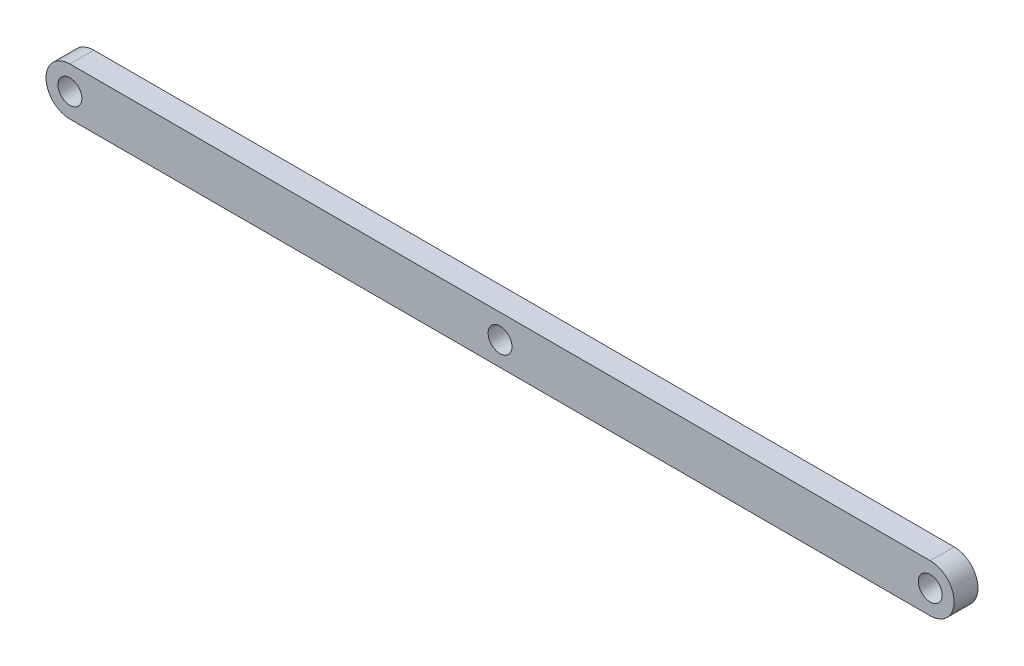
from build123d import *

# Parameters (mm, degrees)
SKETCH1_R           = 1.5875
BOSS_EXTRUDE1_DEPTH = 3.175


with BuildPart() as part:
    # Sketch1 → Boss-Extrude1 (new body)
    with BuildSketch(Plane.XY):
        with BuildLine():
            Line((0, 3.175), (114.3, 3.175))
            ThreePointArc((114.3, 3.175), (117.475, 0), (114.3, -3.175))
            Line((114.3, -3.175), (0, -3.175))
            ThreePointArc((0, -3.175), (-3.175, 0), (0, 3.175))
        make_face()
        Circle(SKETCH1_R, mode=Mode.SUBTRACT)
        with Locations((114.3, 0)):
            Circle(SKETCH1_R, mode=Mode.SUBTRACT)
        with Locations((57.15, 0)):
            Circle(SKETCH1_R, mode=Mode.SUBTRACT)
    extrude(amount=BOSS_EXTRUDE1_DEPTH)


solid = part.part
